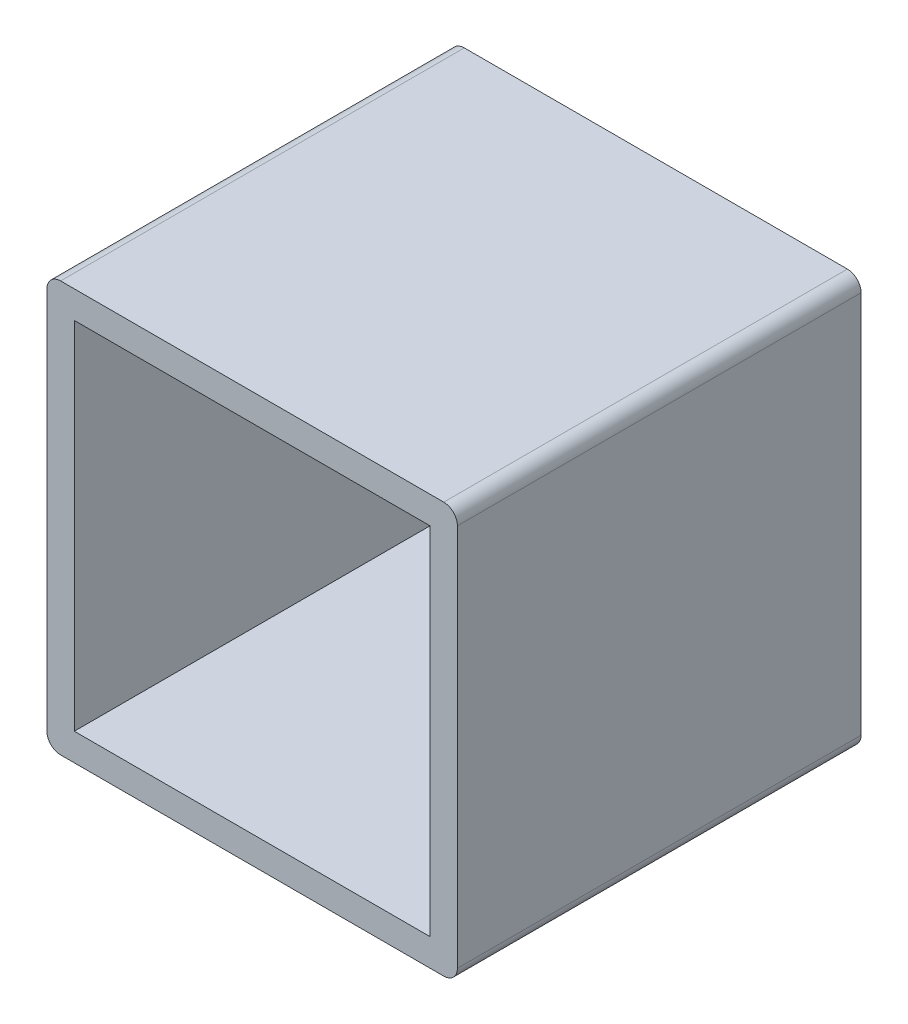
ISO-10303-21;
HEADER;
FILE_DESCRIPTION(('STEP AP214'),'2;1');
FILE_NAME('part.step','',(''),(''),'','','');
FILE_SCHEMA(('AUTOMOTIVE_DESIGN { 1 0 10303 214 1 1 1 1 }'));
ENDSEC;
DATA;
#1=APPLICATION_CONTEXT('core data for automotive mechanical design processes');
#2=APPLICATION_PROTOCOL_DEFINITION('international standard','automotive_design',2000,#1);
#3=PRODUCT_CONTEXT('',#1,'mechanical');
#4=PRODUCT('Part','Part','',(#3));
#5=PRODUCT_RELATED_PRODUCT_CATEGORY('part','',(#4));
#6=PRODUCT_DEFINITION_FORMATION('','',#4);
#7=PRODUCT_DEFINITION_CONTEXT('part definition',#1,'design');
#8=PRODUCT_DEFINITION('design','',#6,#7);
#9=PRODUCT_DEFINITION_SHAPE('','',#8);
#10=(LENGTH_UNIT() NAMED_UNIT(*) SI_UNIT(.MILLI.,.METRE.));
#11=(NAMED_UNIT(*) PLANE_ANGLE_UNIT() SI_UNIT($,.RADIAN.));
#12=(NAMED_UNIT(*) SI_UNIT($,.STERADIAN.) SOLID_ANGLE_UNIT());
#13=UNCERTAINTY_MEASURE_WITH_UNIT(LENGTH_MEASURE(1.E-05),#10,'distance_accuracy_value','');
#14=(GEOMETRIC_REPRESENTATION_CONTEXT(3) GLOBAL_UNCERTAINTY_ASSIGNED_CONTEXT((#13)) GLOBAL_UNIT_ASSIGNED_CONTEXT((#10,
#11,#12)) REPRESENTATION_CONTEXT('',''));
#15=CARTESIAN_POINT('',(0.,0.,0.));
#16=DIRECTION('',(0.,0.,1.));
#17=DIRECTION('',(1.,0.,0.));
#18=AXIS2_PLACEMENT_3D('',#15,#16,#17);
#19=CARTESIAN_POINT('',(-14.,-14.,29.4999999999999));
#20=DIRECTION('',(0.,0.,-1.));
#21=DIRECTION('',(-1.,0.,0.));
#22=AXIS2_PLACEMENT_3D('',#19,#20,#21);
#23=PLANE('',#22);
#24=CARTESIAN_POINT('',(-14.,-14.,29.4999999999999));
#25=DIRECTION('',(0.,0.,-1.));
#26=DIRECTION('',(-1.,0.,0.));
#27=AXIS2_PLACEMENT_3D('',#24,#25,#26);
#28=CIRCLE('',#27,0.999999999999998);
#29=CARTESIAN_POINT('',(-14.,-14.9999999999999,29.4999999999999));
#30=VERTEX_POINT('',#29);
#31=CARTESIAN_POINT('',(-15.,-14.,29.5));
#32=VERTEX_POINT('',#31);
#33=EDGE_CURVE('E178',#30,#32,#28,.T.);
#34=ORIENTED_EDGE('',*,*,#33,.F.);
#35=DIRECTION('',(-1.,0.,0.));
#36=VECTOR('',#35,1.);
#37=CARTESIAN_POINT('',(14.,-14.9999999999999,29.5));
#38=LINE('',#37,#36);
#39=CARTESIAN_POINT('',(14.,-14.9999999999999,29.5));
#40=VERTEX_POINT('',#39);
#41=EDGE_CURVE('E199',#40,#30,#38,.T.);
#42=ORIENTED_EDGE('',*,*,#41,.F.);
#43=CARTESIAN_POINT('',(14.,-14.,29.5));
#44=DIRECTION('',(0.,0.,-1.));
#45=DIRECTION('',(-1.,0.,0.));
#46=AXIS2_PLACEMENT_3D('',#43,#44,#45);
#47=CIRCLE('',#46,1.);
#48=CARTESIAN_POINT('',(15.,-14.,29.5));
#49=VERTEX_POINT('',#48);
#50=EDGE_CURVE('E196',#49,#40,#47,.T.);
#51=ORIENTED_EDGE('',*,*,#50,.F.);
#52=DIRECTION('',(0.,1.,0.));
#53=VECTOR('',#52,1.);
#54=CARTESIAN_POINT('',(15.,-14.,29.5));
#55=LINE('',#54,#53);
#56=CARTESIAN_POINT('',(15.0000000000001,14.,29.5000000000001));
#57=VERTEX_POINT('',#56);
#58=EDGE_CURVE('E193',#49,#57,#55,.T.);
#59=ORIENTED_EDGE('',*,*,#58,.T.);
#60=CARTESIAN_POINT('',(14.0000000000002,14.,29.5000000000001));
#61=DIRECTION('',(0.,0.,1.));
#62=DIRECTION('',(1.,0.,0.));
#63=AXIS2_PLACEMENT_3D('',#60,#61,#62);
#64=CIRCLE('',#63,0.999999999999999);
#65=CARTESIAN_POINT('',(14.0000000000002,15.0000000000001,29.5000000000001));
#66=VERTEX_POINT('',#65);
#67=EDGE_CURVE('E190',#57,#66,#64,.T.);
#68=ORIENTED_EDGE('',*,*,#67,.T.);
#69=DIRECTION('',(1.,0.,0.));
#70=VECTOR('',#69,1.);
#71=CARTESIAN_POINT('',(-13.9999999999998,15.0000000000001,29.5));
#72=LINE('',#71,#70);
#73=CARTESIAN_POINT('',(-13.9999999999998,15.0000000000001,29.5));
#74=VERTEX_POINT('',#73);
#75=EDGE_CURVE('E187',#74,#66,#72,.T.);
#76=ORIENTED_EDGE('',*,*,#75,.F.);
#77=CARTESIAN_POINT('',(-13.9999999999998,14.,29.5));
#78=DIRECTION('',(0.,0.,-1.));
#79=DIRECTION('',(-1.,0.,0.));
#80=AXIS2_PLACEMENT_3D('',#77,#78,#79);
#81=CIRCLE('',#80,0.999999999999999);
#82=CARTESIAN_POINT('',(-14.9999999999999,14.,29.5000000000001));
#83=VERTEX_POINT('',#82);
#84=EDGE_CURVE('E184',#83,#74,#81,.T.);
#85=ORIENTED_EDGE('',*,*,#84,.F.);
#86=DIRECTION('',(0.,-1.,0.));
#87=VECTOR('',#86,1.);
#88=CARTESIAN_POINT('',(-14.9999999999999,14.,29.5000000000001));
#89=LINE('',#88,#87);
#90=EDGE_CURVE('E181',#83,#32,#89,.T.);
#91=ORIENTED_EDGE('',*,*,#90,.T.);
#92=EDGE_LOOP('',(#34,#42,#51,#59,#68,#76,#85,#91));
#93=FACE_BOUND('',#92,.T.);
#94=DIRECTION('',(0.,-1.,0.));
#95=VECTOR('',#94,1.);
#96=CARTESIAN_POINT('',(-13.,-14.,29.4999999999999));
#97=LINE('',#96,#95);
#98=CARTESIAN_POINT('',(-12.9999999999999,13.0000000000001,29.5));
#99=VERTEX_POINT('',#98);
#100=CARTESIAN_POINT('',(-13.,-12.9999999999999,29.4999999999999));
#101=VERTEX_POINT('',#100);
#102=EDGE_CURVE('E120',#99,#101,#97,.T.);
#103=ORIENTED_EDGE('',*,*,#102,.F.);
#104=DIRECTION('',(1.,0.,0.));
#105=VECTOR('',#104,1.);
#106=CARTESIAN_POINT('',(-13.9999999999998,13.0000000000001,29.5));
#107=LINE('',#106,#105);
#108=CARTESIAN_POINT('',(13.0000000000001,13.0000000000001,29.5000000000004));
#109=VERTEX_POINT('',#108);
#110=EDGE_CURVE('E147',#99,#109,#107,.T.);
#111=ORIENTED_EDGE('',*,*,#110,.T.);
#112=DIRECTION('',(0.,1.,0.));
#113=VECTOR('',#112,1.);
#114=CARTESIAN_POINT('',(13.,-14.,29.5000000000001));
#115=LINE('',#114,#113);
#116=CARTESIAN_POINT('',(13.,-12.9999999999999,29.5000000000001));
#117=VERTEX_POINT('',#116);
#118=EDGE_CURVE('E45',#117,#109,#115,.T.);
#119=ORIENTED_EDGE('',*,*,#118,.F.);
#120=DIRECTION('',(-1.,0.,0.));
#121=VECTOR('',#120,1.);
#122=CARTESIAN_POINT('',(-14.,-12.9999999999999,29.5));
#123=LINE('',#122,#121);
#124=EDGE_CURVE('E144',#117,#101,#123,.T.);
#125=ORIENTED_EDGE('',*,*,#124,.T.);
#126=EDGE_LOOP('',(#103,#111,#119,#125));
#127=FACE_BOUND('',#126,.T.);
#128=ADVANCED_FACE('F30',(#93,#127),#23,.F.);
#129=CARTESIAN_POINT('',(-14.,-14.,0.));
#130=DIRECTION('',(0.,0.,-1.));
#131=DIRECTION('',(-1.,0.,0.));
#132=AXIS2_PLACEMENT_3D('',#129,#130,#131);
#133=PLANE('',#132);
#134=CARTESIAN_POINT('',(-14.,-14.,0.));
#135=DIRECTION('',(0.,0.,-1.));
#136=DIRECTION('',(-1.,0.,0.));
#137=AXIS2_PLACEMENT_3D('',#134,#135,#136);
#138=CIRCLE('',#137,0.999999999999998);
#139=CARTESIAN_POINT('',(-14.,-14.9999999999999,-1.2490009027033E-13));
#140=VERTEX_POINT('',#139);
#141=CARTESIAN_POINT('',(-15.,-14.,0.));
#142=VERTEX_POINT('',#141);
#143=EDGE_CURVE('E124',#140,#142,#138,.T.);
#144=ORIENTED_EDGE('',*,*,#143,.T.);
#145=DIRECTION('',(0.,-1.,0.));
#146=VECTOR('',#145,1.);
#147=CARTESIAN_POINT('',(-14.9999999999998,14.,-1.2490009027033E-13));
#148=LINE('',#147,#146);
#149=CARTESIAN_POINT('',(-14.9999999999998,14.,-1.2490009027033E-13));
#150=VERTEX_POINT('',#149);
#151=EDGE_CURVE('E157',#150,#142,#148,.T.);
#152=ORIENTED_EDGE('',*,*,#151,.F.);
#153=CARTESIAN_POINT('',(-13.9999999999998,14.,-1.2490009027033E-13));
#154=DIRECTION('',(0.,0.,-1.));
#155=DIRECTION('',(-1.,0.,0.));
#156=AXIS2_PLACEMENT_3D('',#153,#154,#155);
#157=CIRCLE('',#156,0.999999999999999);
#158=CARTESIAN_POINT('',(-13.9999999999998,15.0000000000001,0.));
#159=VERTEX_POINT('',#158);
#160=EDGE_CURVE('E160',#150,#159,#157,.T.);
#161=ORIENTED_EDGE('',*,*,#160,.T.);
#162=DIRECTION('',(1.,0.,0.));
#163=VECTOR('',#162,1.);
#164=CARTESIAN_POINT('',(-13.9999999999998,15.0000000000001,0.));
#165=LINE('',#164,#163);
#166=CARTESIAN_POINT('',(14.0000000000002,15.0000000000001,2.4980018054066E-13));
#167=VERTEX_POINT('',#166);
#168=EDGE_CURVE('E163',#159,#167,#165,.T.);
#169=ORIENTED_EDGE('',*,*,#168,.T.);
#170=CARTESIAN_POINT('',(14.0000000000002,14.,1.2490009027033E-13));
#171=DIRECTION('',(0.,0.,1.));
#172=DIRECTION('',(1.,0.,0.));
#173=AXIS2_PLACEMENT_3D('',#170,#171,#172);
#174=CIRCLE('',#173,0.999999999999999);
#175=CARTESIAN_POINT('',(15.0000000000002,14.,1.2490009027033E-13));
#176=VERTEX_POINT('',#175);
#177=EDGE_CURVE('E166',#176,#167,#174,.T.);
#178=ORIENTED_EDGE('',*,*,#177,.F.);
#179=DIRECTION('',(0.,1.,0.));
#180=VECTOR('',#179,1.);
#181=CARTESIAN_POINT('',(15.,-14.,2.4980018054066E-13));
#182=LINE('',#181,#180);
#183=CARTESIAN_POINT('',(15.,-14.,2.4980018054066E-13));
#184=VERTEX_POINT('',#183);
#185=EDGE_CURVE('E169',#184,#176,#182,.T.);
#186=ORIENTED_EDGE('',*,*,#185,.F.);
#187=CARTESIAN_POINT('',(14.,-14.,2.4980018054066E-13));
#188=DIRECTION('',(0.,0.,-1.));
#189=DIRECTION('',(-1.,0.,0.));
#190=AXIS2_PLACEMENT_3D('',#187,#188,#189);
#191=CIRCLE('',#190,1.);
#192=CARTESIAN_POINT('',(14.,-14.9999999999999,1.2490009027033E-13));
#193=VERTEX_POINT('',#192);
#194=EDGE_CURVE('E172',#184,#193,#191,.T.);
#195=ORIENTED_EDGE('',*,*,#194,.T.);
#196=DIRECTION('',(-1.,0.,0.));
#197=VECTOR('',#196,1.);
#198=CARTESIAN_POINT('',(14.,-14.9999999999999,1.2490009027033E-13));
#199=LINE('',#198,#197);
#200=EDGE_CURVE('E175',#193,#140,#199,.T.);
#201=ORIENTED_EDGE('',*,*,#200,.T.);
#202=EDGE_LOOP('',(#144,#152,#161,#169,#178,#186,#195,#201));
#203=FACE_BOUND('',#202,.T.);
#204=DIRECTION('',(1.,0.,0.));
#205=VECTOR('',#204,1.);
#206=CARTESIAN_POINT('',(-13.9999999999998,13.0000000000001,-1.2490009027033E-13));
#207=LINE('',#206,#205);
#208=CARTESIAN_POINT('',(-12.9999999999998,13.0000000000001,0.));
#209=VERTEX_POINT('',#208);
#210=CARTESIAN_POINT('',(13.0000000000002,13.0000000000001,2.4980018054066E-13));
#211=VERTEX_POINT('',#210);
#212=EDGE_CURVE('E138',#209,#211,#207,.T.);
#213=ORIENTED_EDGE('',*,*,#212,.F.);
#214=DIRECTION('',(0.,-1.,0.));
#215=VECTOR('',#214,1.);
#216=CARTESIAN_POINT('',(-13.,-14.,-1.2490009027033E-13));
#217=LINE('',#216,#215);
#218=CARTESIAN_POINT('',(-13.,-12.9999999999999,-1.2490009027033E-13));
#219=VERTEX_POINT('',#218);
#220=EDGE_CURVE('E53',#209,#219,#217,.T.);
#221=ORIENTED_EDGE('',*,*,#220,.T.);
#222=DIRECTION('',(-1.,0.,0.));
#223=VECTOR('',#222,1.);
#224=CARTESIAN_POINT('',(-14.,-12.9999999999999,-1.2490009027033E-13));
#225=LINE('',#224,#223);
#226=CARTESIAN_POINT('',(13.,-12.9999999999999,1.2490009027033E-13));
#227=VERTEX_POINT('',#226);
#228=EDGE_CURVE('E128',#227,#219,#225,.T.);
#229=ORIENTED_EDGE('',*,*,#228,.F.);
#230=DIRECTION('',(0.,1.,0.));
#231=VECTOR('',#230,1.);
#232=CARTESIAN_POINT('',(13.,-14.,2.4980018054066E-13));
#233=LINE('',#232,#231);
#234=EDGE_CURVE('E133',#227,#211,#233,.T.);
#235=ORIENTED_EDGE('',*,*,#234,.T.);
#236=EDGE_LOOP('',(#213,#221,#229,#235));
#237=FACE_BOUND('',#236,.T.);
#238=ADVANCED_FACE('F136',(#203,#237),#133,.T.);
#239=CARTESIAN_POINT('',(-14.,-14.,29.4999999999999));
#240=DIRECTION('',(0.,0.,-1.));
#241=DIRECTION('',(-1.,0.,0.));
#242=AXIS2_PLACEMENT_3D('',#239,#240,#241);
#243=CYLINDRICAL_SURFACE('',#242,0.999999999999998);
#244=DIRECTION('',(0.,0.,-1.));
#245=VECTOR('',#244,1.);
#246=CARTESIAN_POINT('',(-14.,-14.9999999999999,29.4999999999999));
#247=LINE('',#246,#245);
#248=EDGE_CURVE('E11',#30,#140,#247,.T.);
#249=ORIENTED_EDGE('',*,*,#248,.F.);
#250=ORIENTED_EDGE('',*,*,#33,.T.);
#251=DIRECTION('',(0.,0.,-1.));
#252=VECTOR('',#251,1.);
#253=CARTESIAN_POINT('',(-15.,-14.,29.5));
#254=LINE('',#253,#252);
#255=EDGE_CURVE('E202',#32,#142,#254,.T.);
#256=ORIENTED_EDGE('',*,*,#255,.T.);
#257=ORIENTED_EDGE('',*,*,#143,.F.);
#258=EDGE_LOOP('',(#249,#250,#256,#257));
#259=FACE_BOUND('',#258,.T.);
#260=ADVANCED_FACE('F226',(#259),#243,.T.);
#261=CARTESIAN_POINT('',(14.,-14.9999999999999,29.5));
#262=DIRECTION('',(0.,-1.,0.));
#263=DIRECTION('',(1.,0.,0.));
#264=AXIS2_PLACEMENT_3D('',#261,#262,#263);
#265=PLANE('',#264);
#266=DIRECTION('',(0.,0.,-1.));
#267=VECTOR('',#266,1.);
#268=CARTESIAN_POINT('',(14.,-14.9999999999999,29.5));
#269=LINE('',#268,#267);
#270=EDGE_CURVE('E38',#40,#193,#269,.T.);
#271=ORIENTED_EDGE('',*,*,#270,.F.);
#272=ORIENTED_EDGE('',*,*,#41,.T.);
#273=ORIENTED_EDGE('',*,*,#248,.T.);
#274=ORIENTED_EDGE('',*,*,#200,.F.);
#275=EDGE_LOOP('',(#271,#272,#273,#274));
#276=FACE_BOUND('',#275,.T.);
#277=ADVANCED_FACE('F32',(#276),#265,.T.);
#278=CARTESIAN_POINT('',(14.,-14.,29.5));
#279=DIRECTION('',(0.,0.,-1.));
#280=DIRECTION('',(-1.,0.,0.));
#281=AXIS2_PLACEMENT_3D('',#278,#279,#280);
#282=CYLINDRICAL_SURFACE('',#281,1.);
#283=DIRECTION('',(0.,0.,-1.));
#284=VECTOR('',#283,1.);
#285=CARTESIAN_POINT('',(15.,-14.,29.5));
#286=LINE('',#285,#284);
#287=EDGE_CURVE('E212',#49,#184,#286,.T.);
#288=ORIENTED_EDGE('',*,*,#287,.F.);
#289=ORIENTED_EDGE('',*,*,#50,.T.);
#290=ORIENTED_EDGE('',*,*,#270,.T.);
#291=ORIENTED_EDGE('',*,*,#194,.F.);
#292=EDGE_LOOP('',(#288,#289,#290,#291));
#293=FACE_BOUND('',#292,.T.);
#294=ADVANCED_FACE('F215',(#293),#282,.T.);
#295=CARTESIAN_POINT('',(15.,-14.,29.5));
#296=DIRECTION('',(-1.,0.,0.));
#297=DIRECTION('',(0.,-1.,0.));
#298=AXIS2_PLACEMENT_3D('',#295,#296,#297);
#299=PLANE('',#298);
#300=DIRECTION('',(0.,0.,-1.));
#301=VECTOR('',#300,1.);
#302=CARTESIAN_POINT('',(15.0000000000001,14.,29.5000000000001));
#303=LINE('',#302,#301);
#304=EDGE_CURVE('E210',#57,#176,#303,.T.);
#305=ORIENTED_EDGE('',*,*,#304,.F.);
#306=ORIENTED_EDGE('',*,*,#58,.F.);
#307=ORIENTED_EDGE('',*,*,#287,.T.);
#308=ORIENTED_EDGE('',*,*,#185,.T.);
#309=EDGE_LOOP('',(#305,#306,#307,#308));
#310=FACE_BOUND('',#309,.T.);
#311=ADVANCED_FACE('F243',(#310),#299,.F.);
#312=CARTESIAN_POINT('',(14.0000000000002,14.,29.5000000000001));
#313=DIRECTION('',(0.,0.,-1.));
#314=DIRECTION('',(-1.,0.,0.));
#315=AXIS2_PLACEMENT_3D('',#312,#313,#314);
#316=CYLINDRICAL_SURFACE('',#315,0.999999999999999);
#317=DIRECTION('',(0.,0.,-1.));
#318=VECTOR('',#317,1.);
#319=CARTESIAN_POINT('',(14.0000000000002,15.0000000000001,29.5000000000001));
#320=LINE('',#319,#318);
#321=EDGE_CURVE('E208',#66,#167,#320,.T.);
#322=ORIENTED_EDGE('',*,*,#321,.F.);
#323=ORIENTED_EDGE('',*,*,#67,.F.);
#324=ORIENTED_EDGE('',*,*,#304,.T.);
#325=ORIENTED_EDGE('',*,*,#177,.T.);
#326=EDGE_LOOP('',(#322,#323,#324,#325));
#327=FACE_BOUND('',#326,.T.);
#328=ADVANCED_FACE('F241',(#327),#316,.T.);
#329=CARTESIAN_POINT('',(-13.9999999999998,15.0000000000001,29.5));
#330=DIRECTION('',(0.,1.,0.));
#331=DIRECTION('',(0.,0.,1.));
#332=AXIS2_PLACEMENT_3D('',#329,#330,#331);
#333=PLANE('',#332);
#334=DIRECTION('',(0.,0.,-1.));
#335=VECTOR('',#334,1.);
#336=CARTESIAN_POINT('',(-13.9999999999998,15.0000000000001,29.5));
#337=LINE('',#336,#335);
#338=EDGE_CURVE('E206',#74,#159,#337,.T.);
#339=ORIENTED_EDGE('',*,*,#338,.F.);
#340=ORIENTED_EDGE('',*,*,#75,.T.);
#341=ORIENTED_EDGE('',*,*,#321,.T.);
#342=ORIENTED_EDGE('',*,*,#168,.F.);
#343=EDGE_LOOP('',(#339,#340,#341,#342));
#344=FACE_BOUND('',#343,.T.);
#345=ADVANCED_FACE('F238',(#344),#333,.T.);
#346=CARTESIAN_POINT('',(-13.9999999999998,14.,29.5));
#347=DIRECTION('',(0.,0.,-1.));
#348=DIRECTION('',(-1.,0.,0.));
#349=AXIS2_PLACEMENT_3D('',#346,#347,#348);
#350=CYLINDRICAL_SURFACE('',#349,0.999999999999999);
#351=DIRECTION('',(0.,0.,-1.));
#352=VECTOR('',#351,1.);
#353=CARTESIAN_POINT('',(-14.9999999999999,14.,29.5000000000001));
#354=LINE('',#353,#352);
#355=EDGE_CURVE('E204',#83,#150,#354,.T.);
#356=ORIENTED_EDGE('',*,*,#355,.F.);
#357=ORIENTED_EDGE('',*,*,#84,.T.);
#358=ORIENTED_EDGE('',*,*,#338,.T.);
#359=ORIENTED_EDGE('',*,*,#160,.F.);
#360=EDGE_LOOP('',(#356,#357,#358,#359));
#361=FACE_BOUND('',#360,.T.);
#362=ADVANCED_FACE('F234',(#361),#350,.T.);
#363=CARTESIAN_POINT('',(-14.9999999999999,14.,29.5000000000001));
#364=DIRECTION('',(1.,0.,0.));
#365=DIRECTION('',(0.,1.,0.));
#366=AXIS2_PLACEMENT_3D('',#363,#364,#365);
#367=PLANE('',#366);
#368=ORIENTED_EDGE('',*,*,#90,.F.);
#369=ORIENTED_EDGE('',*,*,#355,.T.);
#370=ORIENTED_EDGE('',*,*,#151,.T.);
#371=ORIENTED_EDGE('',*,*,#255,.F.);
#372=EDGE_LOOP('',(#368,#369,#370,#371));
#373=FACE_BOUND('',#372,.T.);
#374=ADVANCED_FACE('F231',(#373),#367,.F.);
#375=CARTESIAN_POINT('',(-13.,-14.,29.4999999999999));
#376=DIRECTION('',(1.,0.,0.));
#377=DIRECTION('',(0.,1.,0.));
#378=AXIS2_PLACEMENT_3D('',#375,#376,#377);
#379=PLANE('',#378);
#380=DIRECTION('',(0.,0.,-1.));
#381=VECTOR('',#380,1.);
#382=CARTESIAN_POINT('',(-13.,-12.9999999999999,29.4999999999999));
#383=LINE('',#382,#381);
#384=EDGE_CURVE('E116',#101,#219,#383,.T.);
#385=ORIENTED_EDGE('',*,*,#384,.T.);
#386=ORIENTED_EDGE('',*,*,#220,.F.);
#387=DIRECTION('',(0.,0.,-1.));
#388=VECTOR('',#387,1.);
#389=CARTESIAN_POINT('',(-12.9999999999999,13.0000000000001,29.5));
#390=LINE('',#389,#388);
#391=EDGE_CURVE('E150',#99,#209,#390,.T.);
#392=ORIENTED_EDGE('',*,*,#391,.F.);
#393=ORIENTED_EDGE('',*,*,#102,.T.);
#394=EDGE_LOOP('',(#385,#386,#392,#393));
#395=FACE_BOUND('',#394,.T.);
#396=ADVANCED_FACE('F118',(#395),#379,.T.);
#397=CARTESIAN_POINT('',(-14.,-12.9999999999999,29.5));
#398=DIRECTION('',(0.,-1.,0.));
#399=DIRECTION('',(1.,0.,0.));
#400=AXIS2_PLACEMENT_3D('',#397,#398,#399);
#401=PLANE('',#400);
#402=DIRECTION('',(0.,0.,-1.));
#403=VECTOR('',#402,1.);
#404=CARTESIAN_POINT('',(13.,-12.9999999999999,29.5000000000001));
#405=LINE('',#404,#403);
#406=EDGE_CURVE('E125',#117,#227,#405,.T.);
#407=ORIENTED_EDGE('',*,*,#406,.T.);
#408=ORIENTED_EDGE('',*,*,#228,.T.);
#409=ORIENTED_EDGE('',*,*,#384,.F.);
#410=ORIENTED_EDGE('',*,*,#124,.F.);
#411=EDGE_LOOP('',(#407,#408,#409,#410));
#412=FACE_BOUND('',#411,.T.);
#413=ADVANCED_FACE('F129',(#412),#401,.F.);
#414=CARTESIAN_POINT('',(13.,-14.,29.5000000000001));
#415=DIRECTION('',(-1.,0.,0.));
#416=DIRECTION('',(0.,-1.,0.));
#417=AXIS2_PLACEMENT_3D('',#414,#415,#416);
#418=PLANE('',#417);
#419=DIRECTION('',(0.,0.,-1.));
#420=VECTOR('',#419,1.);
#421=CARTESIAN_POINT('',(13.0000000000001,13.0000000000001,29.5000000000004));
#422=LINE('',#421,#420);
#423=EDGE_CURVE('E152',#109,#211,#422,.T.);
#424=ORIENTED_EDGE('',*,*,#423,.T.);
#425=ORIENTED_EDGE('',*,*,#234,.F.);
#426=ORIENTED_EDGE('',*,*,#406,.F.);
#427=ORIENTED_EDGE('',*,*,#118,.T.);
#428=EDGE_LOOP('',(#424,#425,#426,#427));
#429=FACE_BOUND('',#428,.T.);
#430=ADVANCED_FACE('F252',(#429),#418,.T.);
#431=CARTESIAN_POINT('',(-13.9999999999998,13.0000000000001,29.5));
#432=DIRECTION('',(0.,1.,0.));
#433=DIRECTION('',(0.,0.,1.));
#434=AXIS2_PLACEMENT_3D('',#431,#432,#433);
#435=PLANE('',#434);
#436=ORIENTED_EDGE('',*,*,#110,.F.);
#437=ORIENTED_EDGE('',*,*,#391,.T.);
#438=ORIENTED_EDGE('',*,*,#212,.T.);
#439=ORIENTED_EDGE('',*,*,#423,.F.);
#440=EDGE_LOOP('',(#436,#437,#438,#439));
#441=FACE_BOUND('',#440,.T.);
#442=ADVANCED_FACE('F251',(#441),#435,.F.);
#443=CLOSED_SHELL('',(#128,#238,#260,#277,#294,#311,#328,#345,#362,#374,#396,#413,#430,#442));
#444=MANIFOLD_SOLID_BREP('B2',#443);
#445=ADVANCED_BREP_SHAPE_REPRESENTATION('',(#18,#444),#14);
#446=SHAPE_DEFINITION_REPRESENTATION(#9,#445);
ENDSEC;
END-ISO-10303-21;
